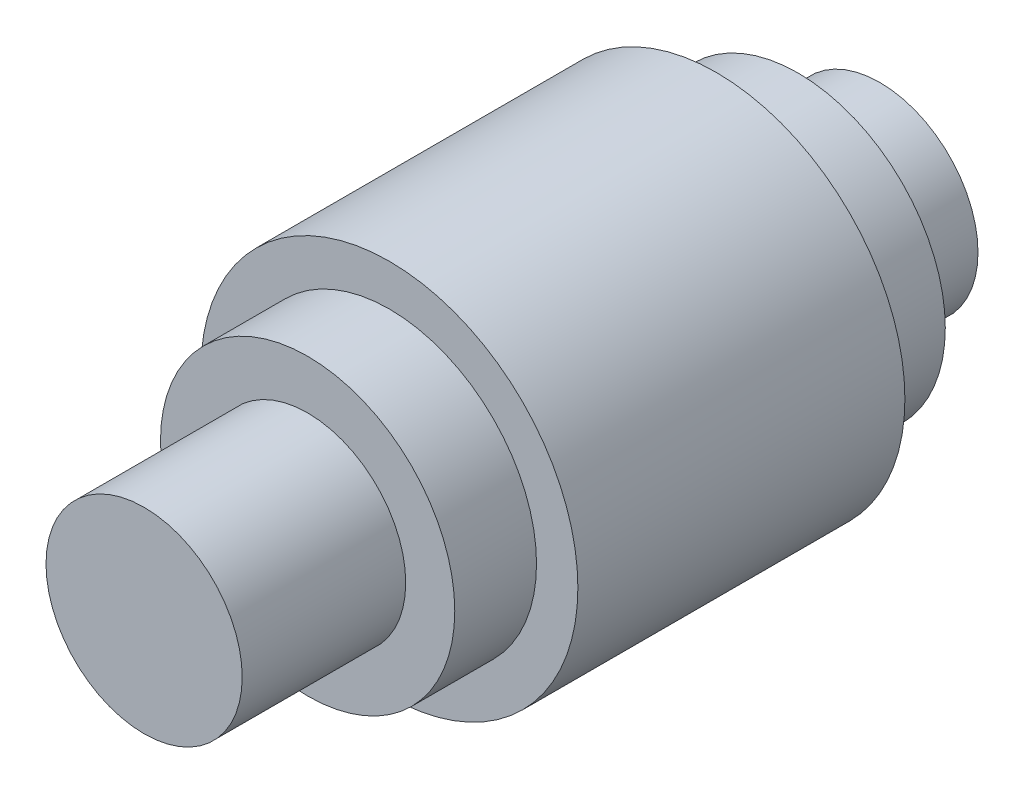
from build123d import *

# Parameters (mm, degrees)
SKETCH2_R           = 11.529302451
BOSS_EXTRUDE1_DEPTH = 20
SKETCH3_R           = 9
BOSS_EXTRUDE2_DEPTH = 5
SKETCH4_R           = 6
BOSS_EXTRUDE3_DEPTH = 10
BOSS_EXTRUDE7_START = 5
SKETCH10_R          = 9
BOSS_EXTRUDE7_DEPTH = 5
BOSS_EXTRUDE8_START = 5
SKETCH11_R          = 6
BOSS_EXTRUDE8_DEPTH = 5


with BuildPart() as part:
    # Sketch2 → Boss-Extrude1 (new body)
    with BuildSketch(Plane.XY):
        Circle(SKETCH2_R)
    extrude(amount=BOSS_EXTRUDE1_DEPTH)

    # Sketch3 → Boss-Extrude2 (add)
    with BuildSketch(Plane.XY.offset(20)):
        Circle(SKETCH3_R)
    extrude(amount=BOSS_EXTRUDE2_DEPTH)

    # Sketch4 → Boss-Extrude3 (add)
    with BuildSketch(Plane.XY.offset(25)):
        Circle(SKETCH4_R)
    extrude(amount=BOSS_EXTRUDE3_DEPTH)

    # Sketch10 → Boss-Extrude7 (add)
    with BuildSketch(Plane(origin=(0, 0, 0), x_dir=(-1, 0, 0), z_dir=(0, 0, -1)).offset(BOSS_EXTRUDE7_START)):
        with Locations(Location((0, 0, 0), (0, 0, 180))):
            Circle(SKETCH10_R)
    extrude(amount=-BOSS_EXTRUDE7_DEPTH)

    # Sketch11 → Boss-Extrude8 (add)
    with BuildSketch(Plane(origin=(0, 0, -5), x_dir=(-1, 0, 0), z_dir=(0, 0, -1)).offset(BOSS_EXTRUDE8_START)):
        with Locations(Location((0, 0, 0), (0, 0, 180))):
            Circle(SKETCH11_R)
    extrude(amount=-BOSS_EXTRUDE8_DEPTH)


solid = part.part
